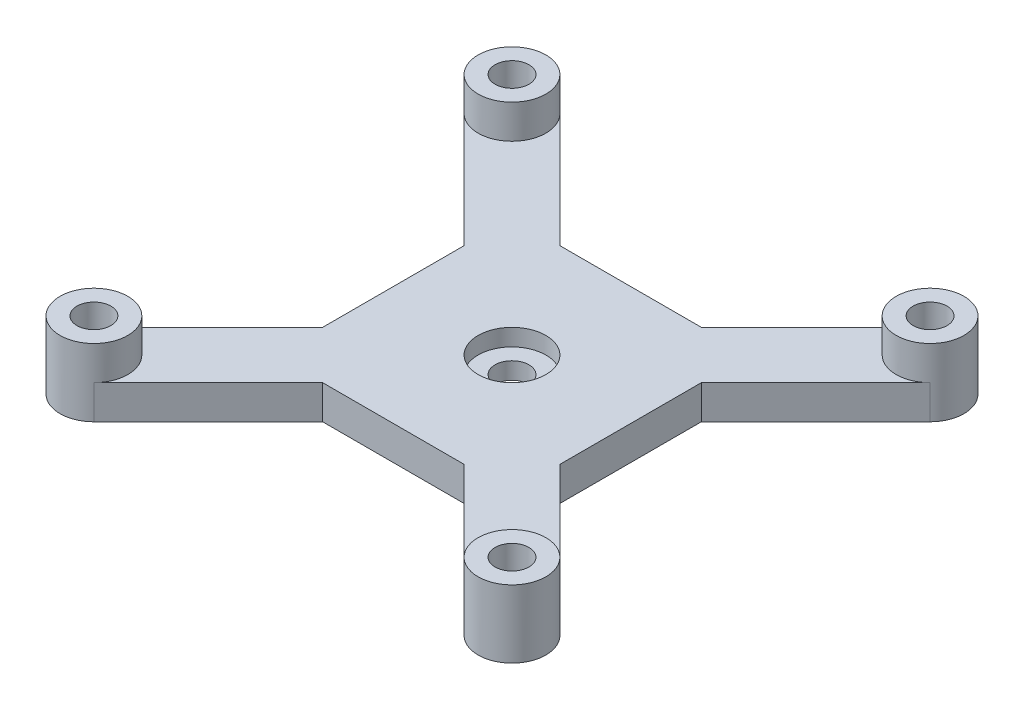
ISO-10303-21;
HEADER;
FILE_DESCRIPTION(('STEP AP214'),'2;1');
FILE_NAME('part.step','',(''),(''),'','','');
FILE_SCHEMA(('AUTOMOTIVE_DESIGN { 1 0 10303 214 1 1 1 1 }'));
ENDSEC;
DATA;
#1=APPLICATION_CONTEXT('core data for automotive mechanical design processes');
#2=APPLICATION_PROTOCOL_DEFINITION('international standard','automotive_design',2000,#1);
#3=PRODUCT_CONTEXT('',#1,'mechanical');
#4=PRODUCT('Part','Part','',(#3));
#5=PRODUCT_RELATED_PRODUCT_CATEGORY('part','',(#4));
#6=PRODUCT_DEFINITION_FORMATION('','',#4);
#7=PRODUCT_DEFINITION_CONTEXT('part definition',#1,'design');
#8=PRODUCT_DEFINITION('design','',#6,#7);
#9=PRODUCT_DEFINITION_SHAPE('','',#8);
#10=(LENGTH_UNIT() NAMED_UNIT(*) SI_UNIT(.MILLI.,.METRE.));
#11=(NAMED_UNIT(*) PLANE_ANGLE_UNIT() SI_UNIT($,.RADIAN.));
#12=(NAMED_UNIT(*) SI_UNIT($,.STERADIAN.) SOLID_ANGLE_UNIT());
#13=UNCERTAINTY_MEASURE_WITH_UNIT(LENGTH_MEASURE(1.E-05),#10,'distance_accuracy_value','');
#14=(GEOMETRIC_REPRESENTATION_CONTEXT(3) GLOBAL_UNCERTAINTY_ASSIGNED_CONTEXT((#13)) GLOBAL_UNIT_ASSIGNED_CONTEXT((#10,
#11,#12)) REPRESENTATION_CONTEXT('',''));
#15=CARTESIAN_POINT('',(0.,0.,0.));
#16=DIRECTION('',(0.,0.,1.));
#17=DIRECTION('',(1.,0.,0.));
#18=AXIS2_PLACEMENT_3D('',#15,#16,#17);
#19=CARTESIAN_POINT('',(-27.8991492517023,3.,-10.0179886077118));
#20=DIRECTION('',(0.,1.,0.));
#21=DIRECTION('',(0.,0.,1.));
#22=AXIS2_PLACEMENT_3D('',#19,#20,#21);
#23=PLANE('',#22);
#24=CARTESIAN_POINT('',(-9.39914925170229,3.,8.48201139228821));
#25=DIRECTION('',(0.,1.,0.));
#26=DIRECTION('',(0.,0.,1.));
#27=AXIS2_PLACEMENT_3D('',#24,#25,#26);
#28=CIRCLE('',#27,3.);
#29=CARTESIAN_POINT('',(-9.39914925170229,3.,11.4820113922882));
#30=VERTEX_POINT('',#29);
#31=EDGE_CURVE('E189',#30,#30,#28,.T.);
#32=ORIENTED_EDGE('',*,*,#31,.F.);
#33=EDGE_LOOP('',(#32));
#34=FACE_BOUND('',#33,.T.);
#35=DIRECTION('',(-0.707106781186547,0.,0.707106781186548));
#36=VECTOR('',#35,1.);
#37=CARTESIAN_POINT('',(-30.0204695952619,3.,24.8606910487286));
#38=LINE('',#37,#36);
#39=CARTESIAN_POINT('',(-19.8991492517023,3.,14.7393707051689));
#40=VERTEX_POINT('',#39);
#41=CARTESIAN_POINT('',(-30.0204695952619,3.,24.8606910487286));
#42=VERTEX_POINT('',#41);
#43=EDGE_CURVE('E213',#40,#42,#38,.T.);
#44=ORIENTED_EDGE('',*,*,#43,.T.);
#45=CARTESIAN_POINT('',(-27.8991492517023,3.,26.9820113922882));
#46=DIRECTION('',(0.,1.,0.));
#47=DIRECTION('',(0.,0.,1.));
#48=AXIS2_PLACEMENT_3D('',#45,#46,#47);
#49=CIRCLE('',#48,3.);
#50=CARTESIAN_POINT('',(-25.7778289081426,3.,29.1033317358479));
#51=VERTEX_POINT('',#50);
#52=EDGE_CURVE('E325',#51,#42,#49,.T.);
#53=ORIENTED_EDGE('',*,*,#52,.F.);
#54=DIRECTION('',(0.707106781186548,0.,-0.707106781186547));
#55=VECTOR('',#54,1.);
#56=CARTESIAN_POINT('',(-25.7778289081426,3.,29.1033317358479));
#57=LINE('',#56,#55);
#58=CARTESIAN_POINT('',(-15.656508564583,3.,18.9820113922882));
#59=VERTEX_POINT('',#58);
#60=EDGE_CURVE('E216',#51,#59,#57,.T.);
#61=ORIENTED_EDGE('',*,*,#60,.T.);
#62=DIRECTION('',(1.,0.,0.));
#63=VECTOR('',#62,1.);
#64=CARTESIAN_POINT('',(-15.656508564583,3.,18.9820113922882));
#65=LINE('',#64,#63);
#66=CARTESIAN_POINT('',(-3.14178993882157,3.,18.9820113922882));
#67=VERTEX_POINT('',#66);
#68=EDGE_CURVE('E218',#59,#67,#65,.T.);
#69=ORIENTED_EDGE('',*,*,#68,.T.);
#70=DIRECTION('',(0.707106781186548,0.,0.707106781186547));
#71=VECTOR('',#70,1.);
#72=CARTESIAN_POINT('',(-3.14178993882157,3.,18.9820113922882));
#73=LINE('',#72,#71);
#74=CARTESIAN_POINT('',(6.97953040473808,3.,29.1033317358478));
#75=VERTEX_POINT('',#74);
#76=EDGE_CURVE('E220',#67,#75,#73,.T.);
#77=ORIENTED_EDGE('',*,*,#76,.T.);
#78=CARTESIAN_POINT('',(9.10085074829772,3.,26.9820113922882));
#79=DIRECTION('',(0.,1.,0.));
#80=DIRECTION('',(0.,0.,1.));
#81=AXIS2_PLACEMENT_3D('',#78,#79,#80);
#82=CIRCLE('',#81,3.);
#83=CARTESIAN_POINT('',(11.2221710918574,3.,24.8606910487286));
#84=VERTEX_POINT('',#83);
#85=EDGE_CURVE('E343',#84,#75,#82,.T.);
#86=ORIENTED_EDGE('',*,*,#85,.F.);
#87=DIRECTION('',(-0.707106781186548,0.,-0.707106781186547));
#88=VECTOR('',#87,1.);
#89=CARTESIAN_POINT('',(1.10085074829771,3.,14.7393707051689));
#90=LINE('',#89,#88);
#91=CARTESIAN_POINT('',(1.10085074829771,3.,14.7393707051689));
#92=VERTEX_POINT('',#91);
#93=EDGE_CURVE('E222',#84,#92,#90,.T.);
#94=ORIENTED_EDGE('',*,*,#93,.T.);
#95=DIRECTION('',(0.,0.,-1.));
#96=VECTOR('',#95,1.);
#97=CARTESIAN_POINT('',(1.1008507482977,3.,2.22465207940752));
#98=LINE('',#97,#96);
#99=CARTESIAN_POINT('',(1.1008507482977,3.,2.22465207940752));
#100=VERTEX_POINT('',#99);
#101=EDGE_CURVE('E151',#92,#100,#98,.T.);
#102=ORIENTED_EDGE('',*,*,#101,.T.);
#103=DIRECTION('',(0.707106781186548,0.,-0.707106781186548));
#104=VECTOR('',#103,1.);
#105=CARTESIAN_POINT('',(1.1008507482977,3.,2.22465207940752));
#106=LINE('',#105,#104);
#107=CARTESIAN_POINT('',(11.2221710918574,3.,-7.89666826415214));
#108=VERTEX_POINT('',#107);
#109=EDGE_CURVE('E145',#100,#108,#106,.T.);
#110=ORIENTED_EDGE('',*,*,#109,.T.);
#111=CARTESIAN_POINT('',(9.10085074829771,3.,-10.0179886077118));
#112=DIRECTION('',(0.,1.,0.));
#113=DIRECTION('',(0.,0.,1.));
#114=AXIS2_PLACEMENT_3D('',#111,#112,#113);
#115=CIRCLE('',#114,3.00000000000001);
#116=CARTESIAN_POINT('',(6.97953040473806,3.,-12.1393089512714));
#117=VERTEX_POINT('',#116);
#118=EDGE_CURVE('E149',#117,#108,#115,.T.);
#119=ORIENTED_EDGE('',*,*,#118,.F.);
#120=DIRECTION('',(-0.707106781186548,0.,0.707106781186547));
#121=VECTOR('',#120,1.);
#122=CARTESIAN_POINT('',(-3.14178993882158,3.,-2.01798860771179));
#123=LINE('',#122,#121);
#124=CARTESIAN_POINT('',(-3.14178993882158,3.,-2.01798860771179));
#125=VERTEX_POINT('',#124);
#126=EDGE_CURVE('E155',#117,#125,#123,.T.);
#127=ORIENTED_EDGE('',*,*,#126,.T.);
#128=DIRECTION('',(-1.,0.,0.));
#129=VECTOR('',#128,1.);
#130=CARTESIAN_POINT('',(-15.656508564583,3.,-2.01798860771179));
#131=LINE('',#130,#129);
#132=CARTESIAN_POINT('',(-15.656508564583,3.,-2.01798860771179));
#133=VERTEX_POINT('',#132);
#134=EDGE_CURVE('E51',#125,#133,#131,.T.);
#135=ORIENTED_EDGE('',*,*,#134,.T.);
#136=DIRECTION('',(-0.707106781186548,0.,-0.707106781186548));
#137=VECTOR('',#136,1.);
#138=CARTESIAN_POINT('',(-25.7778289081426,3.,-12.1393089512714));
#139=LINE('',#138,#137);
#140=CARTESIAN_POINT('',(-25.7778289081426,3.,-12.1393089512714));
#141=VERTEX_POINT('',#140);
#142=EDGE_CURVE('E227',#133,#141,#139,.T.);
#143=ORIENTED_EDGE('',*,*,#142,.T.);
#144=CARTESIAN_POINT('',(-27.8991492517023,3.,-10.0179886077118));
#145=DIRECTION('',(0.,1.,0.));
#146=DIRECTION('',(0.,0.,1.));
#147=AXIS2_PLACEMENT_3D('',#144,#145,#146);
#148=CIRCLE('',#147,3.);
#149=CARTESIAN_POINT('',(-30.0204695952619,3.,-7.89666826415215));
#150=VERTEX_POINT('',#149);
#151=EDGE_CURVE('E11',#150,#141,#148,.T.);
#152=ORIENTED_EDGE('',*,*,#151,.F.);
#153=DIRECTION('',(0.707106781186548,0.,0.707106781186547));
#154=VECTOR('',#153,1.);
#155=CARTESIAN_POINT('',(-30.0204695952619,3.,-7.89666826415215));
#156=LINE('',#155,#154);
#157=CARTESIAN_POINT('',(-19.8991492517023,3.,2.22465207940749));
#158=VERTEX_POINT('',#157);
#159=EDGE_CURVE('E214',#150,#158,#156,.T.);
#160=ORIENTED_EDGE('',*,*,#159,.T.);
#161=DIRECTION('',(0.,0.,1.));
#162=VECTOR('',#161,1.);
#163=CARTESIAN_POINT('',(-19.8991492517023,3.,2.22465207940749));
#164=LINE('',#163,#162);
#165=EDGE_CURVE('E211',#158,#40,#164,.T.);
#166=ORIENTED_EDGE('',*,*,#165,.T.);
#167=EDGE_LOOP('',(#44,#53,#61,#69,#77,#86,#94,#102,#110,#119,#127,#135,#143,#152,#160,#166));
#168=FACE_BOUND('',#167,.T.);
#169=ADVANCED_FACE('F32',(#34,#168),#23,.T.);
#170=CARTESIAN_POINT('',(-9.39914925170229,3.,8.48201139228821));
#171=DIRECTION('',(0.,-1.,0.));
#172=DIRECTION('',(0.,0.,-1.));
#173=AXIS2_PLACEMENT_3D('',#170,#171,#172);
#174=CYLINDRICAL_SURFACE('',#173,1.5);
#175=CARTESIAN_POINT('',(-9.39914925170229,0.,8.48201139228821));
#176=DIRECTION('',(0.,1.,0.));
#177=DIRECTION('',(0.,0.,1.));
#178=AXIS2_PLACEMENT_3D('',#175,#176,#177);
#179=CIRCLE('',#178,1.5);
#180=CARTESIAN_POINT('',(-9.39914925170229,0.,9.98201139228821));
#181=VERTEX_POINT('',#180);
#182=EDGE_CURVE('E193',#181,#181,#179,.T.);
#183=ORIENTED_EDGE('',*,*,#182,.F.);
#184=EDGE_LOOP('',(#183));
#185=FACE_BOUND('',#184,.T.);
#186=CARTESIAN_POINT('',(-9.39914925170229,1.5,8.48201139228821));
#187=DIRECTION('',(0.,1.,0.));
#188=DIRECTION('',(0.,0.,1.));
#189=AXIS2_PLACEMENT_3D('',#186,#187,#188);
#190=CIRCLE('',#189,1.5);
#191=CARTESIAN_POINT('',(-9.39914925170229,1.5,9.98201139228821));
#192=VERTEX_POINT('',#191);
#193=EDGE_CURVE('E186',#192,#192,#190,.T.);
#194=ORIENTED_EDGE('',*,*,#193,.T.);
#195=EDGE_LOOP('',(#194));
#196=FACE_BOUND('',#195,.T.);
#197=ADVANCED_FACE('F377',(#185,#196),#174,.F.);
#198=CARTESIAN_POINT('',(-27.8991492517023,0.,-10.0179886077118));
#199=DIRECTION('',(0.,1.,0.));
#200=DIRECTION('',(0.,0.,1.));
#201=AXIS2_PLACEMENT_3D('',#198,#199,#200);
#202=PLANE('',#201);
#203=CARTESIAN_POINT('',(-27.8991492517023,0.,26.9820113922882));
#204=DIRECTION('',(0.,1.,0.));
#205=DIRECTION('',(0.,0.,1.));
#206=AXIS2_PLACEMENT_3D('',#203,#204,#205);
#207=CIRCLE('',#206,1.5);
#208=CARTESIAN_POINT('',(-27.8991492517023,0.,28.4820113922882));
#209=VERTEX_POINT('',#208);
#210=EDGE_CURVE('E198',#209,#209,#207,.T.);
#211=ORIENTED_EDGE('',*,*,#210,.T.);
#212=EDGE_LOOP('',(#211));
#213=FACE_BOUND('',#212,.T.);
#214=CARTESIAN_POINT('',(9.10085074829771,0.,-10.0179886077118));
#215=DIRECTION('',(0.,1.,0.));
#216=DIRECTION('',(0.,0.,1.));
#217=AXIS2_PLACEMENT_3D('',#214,#215,#216);
#218=CIRCLE('',#217,1.5);
#219=CARTESIAN_POINT('',(9.10085074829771,0.,-8.51798860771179));
#220=VERTEX_POINT('',#219);
#221=EDGE_CURVE('E204',#220,#220,#218,.T.);
#222=ORIENTED_EDGE('',*,*,#221,.T.);
#223=EDGE_LOOP('',(#222));
#224=FACE_BOUND('',#223,.T.);
#225=CARTESIAN_POINT('',(-27.8991492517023,0.,-10.0179886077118));
#226=DIRECTION('',(0.,1.,0.));
#227=DIRECTION('',(0.,0.,1.));
#228=AXIS2_PLACEMENT_3D('',#225,#226,#227);
#229=CIRCLE('',#228,3.);
#230=CARTESIAN_POINT('',(-25.7778289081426,0.,-12.1393089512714));
#231=VERTEX_POINT('',#230);
#232=CARTESIAN_POINT('',(-30.0204695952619,0.,-7.89666826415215));
#233=VERTEX_POINT('',#232);
#234=EDGE_CURVE('E210',#231,#233,#229,.T.);
#235=ORIENTED_EDGE('',*,*,#234,.F.);
#236=DIRECTION('',(-0.707106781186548,0.,-0.707106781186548));
#237=VECTOR('',#236,1.);
#238=CARTESIAN_POINT('',(-25.7778289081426,0.,-12.1393089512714));
#239=LINE('',#238,#237);
#240=CARTESIAN_POINT('',(-15.656508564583,0.,-2.01798860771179));
#241=VERTEX_POINT('',#240);
#242=EDGE_CURVE('E111',#241,#231,#239,.T.);
#243=ORIENTED_EDGE('',*,*,#242,.F.);
#244=DIRECTION('',(-1.,0.,0.));
#245=VECTOR('',#244,1.);
#246=CARTESIAN_POINT('',(-15.656508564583,0.,-2.01798860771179));
#247=LINE('',#246,#245);
#248=CARTESIAN_POINT('',(-3.14178993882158,0.,-2.01798860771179));
#249=VERTEX_POINT('',#248);
#250=EDGE_CURVE('E104',#249,#241,#247,.T.);
#251=ORIENTED_EDGE('',*,*,#250,.F.);
#252=DIRECTION('',(-0.707106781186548,0.,0.707106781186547));
#253=VECTOR('',#252,1.);
#254=CARTESIAN_POINT('',(-3.14178993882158,0.,-2.01798860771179));
#255=LINE('',#254,#253);
#256=CARTESIAN_POINT('',(6.97953040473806,0.,-12.1393089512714));
#257=VERTEX_POINT('',#256);
#258=EDGE_CURVE('E253',#257,#249,#255,.T.);
#259=ORIENTED_EDGE('',*,*,#258,.F.);
#260=CARTESIAN_POINT('',(9.10085074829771,0.,-10.0179886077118));
#261=DIRECTION('',(0.,1.,0.));
#262=DIRECTION('',(0.,0.,1.));
#263=AXIS2_PLACEMENT_3D('',#260,#261,#262);
#264=CIRCLE('',#263,3.00000000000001);
#265=CARTESIAN_POINT('',(11.2221710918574,0.,-7.89666826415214));
#266=VERTEX_POINT('',#265);
#267=EDGE_CURVE('E251',#266,#257,#264,.T.);
#268=ORIENTED_EDGE('',*,*,#267,.F.);
#269=DIRECTION('',(0.707106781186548,0.,-0.707106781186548));
#270=VECTOR('',#269,1.);
#271=CARTESIAN_POINT('',(1.1008507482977,0.,2.22465207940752));
#272=LINE('',#271,#270);
#273=CARTESIAN_POINT('',(1.1008507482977,0.,2.22465207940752));
#274=VERTEX_POINT('',#273);
#275=EDGE_CURVE('E161',#274,#266,#272,.T.);
#276=ORIENTED_EDGE('',*,*,#275,.F.);
#277=DIRECTION('',(0.,0.,-1.));
#278=VECTOR('',#277,1.);
#279=CARTESIAN_POINT('',(1.1008507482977,0.,2.22465207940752));
#280=LINE('',#279,#278);
#281=CARTESIAN_POINT('',(1.10085074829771,0.,14.7393707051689));
#282=VERTEX_POINT('',#281);
#283=EDGE_CURVE('E248',#282,#274,#280,.T.);
#284=ORIENTED_EDGE('',*,*,#283,.F.);
#285=DIRECTION('',(-0.707106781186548,0.,-0.707106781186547));
#286=VECTOR('',#285,1.);
#287=CARTESIAN_POINT('',(1.10085074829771,0.,14.7393707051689));
#288=LINE('',#287,#286);
#289=CARTESIAN_POINT('',(11.2221710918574,0.,24.8606910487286));
#290=VERTEX_POINT('',#289);
#291=EDGE_CURVE('E246',#290,#282,#288,.T.);
#292=ORIENTED_EDGE('',*,*,#291,.F.);
#293=CARTESIAN_POINT('',(9.10085074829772,0.,26.9820113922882));
#294=DIRECTION('',(0.,1.,0.));
#295=DIRECTION('',(0.,0.,1.));
#296=AXIS2_PLACEMENT_3D('',#293,#294,#295);
#297=CIRCLE('',#296,3.);
#298=CARTESIAN_POINT('',(6.97953040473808,0.,29.1033317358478));
#299=VERTEX_POINT('',#298);
#300=EDGE_CURVE('E244',#299,#290,#297,.T.);
#301=ORIENTED_EDGE('',*,*,#300,.F.);
#302=DIRECTION('',(0.707106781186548,0.,0.707106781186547));
#303=VECTOR('',#302,1.);
#304=CARTESIAN_POINT('',(-3.14178993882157,0.,18.9820113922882));
#305=LINE('',#304,#303);
#306=CARTESIAN_POINT('',(-3.14178993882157,0.,18.9820113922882));
#307=VERTEX_POINT('',#306);
#308=EDGE_CURVE('E242',#307,#299,#305,.T.);
#309=ORIENTED_EDGE('',*,*,#308,.F.);
#310=DIRECTION('',(1.,0.,0.));
#311=VECTOR('',#310,1.);
#312=CARTESIAN_POINT('',(-15.656508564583,0.,18.9820113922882));
#313=LINE('',#312,#311);
#314=CARTESIAN_POINT('',(-15.656508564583,0.,18.9820113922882));
#315=VERTEX_POINT('',#314);
#316=EDGE_CURVE('E240',#315,#307,#313,.T.);
#317=ORIENTED_EDGE('',*,*,#316,.F.);
#318=DIRECTION('',(0.707106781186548,0.,-0.707106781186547));
#319=VECTOR('',#318,1.);
#320=CARTESIAN_POINT('',(-25.7778289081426,0.,29.1033317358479));
#321=LINE('',#320,#319);
#322=CARTESIAN_POINT('',(-25.7778289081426,0.,29.1033317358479));
#323=VERTEX_POINT('',#322);
#324=EDGE_CURVE('E238',#323,#315,#321,.T.);
#325=ORIENTED_EDGE('',*,*,#324,.F.);
#326=CARTESIAN_POINT('',(-27.8991492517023,0.,26.9820113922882));
#327=DIRECTION('',(0.,1.,0.));
#328=DIRECTION('',(0.,0.,1.));
#329=AXIS2_PLACEMENT_3D('',#326,#327,#328);
#330=CIRCLE('',#329,3.);
#331=CARTESIAN_POINT('',(-30.0204695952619,0.,24.8606910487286));
#332=VERTEX_POINT('',#331);
#333=EDGE_CURVE('E236',#332,#323,#330,.T.);
#334=ORIENTED_EDGE('',*,*,#333,.F.);
#335=DIRECTION('',(-0.707106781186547,0.,0.707106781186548));
#336=VECTOR('',#335,1.);
#337=CARTESIAN_POINT('',(-30.0204695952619,0.,24.8606910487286));
#338=LINE('',#337,#336);
#339=CARTESIAN_POINT('',(-19.8991492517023,0.,14.7393707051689));
#340=VERTEX_POINT('',#339);
#341=EDGE_CURVE('E234',#340,#332,#338,.T.);
#342=ORIENTED_EDGE('',*,*,#341,.F.);
#343=DIRECTION('',(0.,0.,1.));
#344=VECTOR('',#343,1.);
#345=CARTESIAN_POINT('',(-19.8991492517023,0.,2.22465207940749));
#346=LINE('',#345,#344);
#347=CARTESIAN_POINT('',(-19.8991492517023,0.,2.22465207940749));
#348=VERTEX_POINT('',#347);
#349=EDGE_CURVE('E232',#348,#340,#346,.T.);
#350=ORIENTED_EDGE('',*,*,#349,.F.);
#351=DIRECTION('',(0.707106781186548,0.,0.707106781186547));
#352=VECTOR('',#351,1.);
#353=CARTESIAN_POINT('',(-30.0204695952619,0.,-7.89666826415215));
#354=LINE('',#353,#352);
#355=EDGE_CURVE('E230',#233,#348,#354,.T.);
#356=ORIENTED_EDGE('',*,*,#355,.F.);
#357=EDGE_LOOP('',(#235,#243,#251,#259,#268,#276,#284,#292,#301,#309,#317,#325,#334,#342,#350,#356));
#358=FACE_BOUND('',#357,.T.);
#359=CARTESIAN_POINT('',(-27.8991492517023,0.,-10.0179886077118));
#360=DIRECTION('',(0.,1.,0.));
#361=DIRECTION('',(0.,0.,1.));
#362=AXIS2_PLACEMENT_3D('',#359,#360,#361);
#363=CIRCLE('',#362,1.5);
#364=CARTESIAN_POINT('',(-27.8991492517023,0.,-8.51798860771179));
#365=VERTEX_POINT('',#364);
#366=EDGE_CURVE('E207',#365,#365,#363,.T.);
#367=ORIENTED_EDGE('',*,*,#366,.T.);
#368=EDGE_LOOP('',(#367));
#369=FACE_BOUND('',#368,.T.);
#370=CARTESIAN_POINT('',(9.10085074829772,0.,26.9820113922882));
#371=DIRECTION('',(0.,1.,0.));
#372=DIRECTION('',(0.,0.,1.));
#373=AXIS2_PLACEMENT_3D('',#370,#371,#372);
#374=CIRCLE('',#373,1.5);
#375=CARTESIAN_POINT('',(9.10085074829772,0.,28.4820113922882));
#376=VERTEX_POINT('',#375);
#377=EDGE_CURVE('E201',#376,#376,#374,.T.);
#378=ORIENTED_EDGE('',*,*,#377,.T.);
#379=EDGE_LOOP('',(#378));
#380=FACE_BOUND('',#379,.T.);
#381=ORIENTED_EDGE('',*,*,#182,.T.);
#382=EDGE_LOOP('',(#381));
#383=FACE_BOUND('',#382,.T.);
#384=ADVANCED_FACE('F309',(#213,#224,#358,#369,#380,#383),#202,.F.);
#385=CARTESIAN_POINT('',(-27.8991492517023,3.,-10.0179886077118));
#386=DIRECTION('',(0.,-1.,0.));
#387=DIRECTION('',(0.,0.,-1.));
#388=AXIS2_PLACEMENT_3D('',#385,#386,#387);
#389=CYLINDRICAL_SURFACE('',#388,3.);
#390=ORIENTED_EDGE('',*,*,#234,.T.);
#391=DIRECTION('',(0.,-1.,0.));
#392=VECTOR('',#391,1.);
#393=CARTESIAN_POINT('',(-30.0204695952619,3.,-7.89666826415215));
#394=LINE('',#393,#392);
#395=EDGE_CURVE('E42',#150,#233,#394,.T.);
#396=ORIENTED_EDGE('',*,*,#395,.F.);
#397=ORIENTED_EDGE('',*,*,#151,.T.);
#398=DIRECTION('',(0.,-1.,0.));
#399=VECTOR('',#398,1.);
#400=CARTESIAN_POINT('',(-25.7778289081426,3.,-12.1393089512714));
#401=LINE('',#400,#399);
#402=EDGE_CURVE('E260',#141,#231,#401,.T.);
#403=ORIENTED_EDGE('',*,*,#402,.T.);
#404=EDGE_LOOP('',(#390,#396,#397,#403));
#405=FACE_BOUND('',#404,.T.);
#406=CARTESIAN_POINT('',(-27.8991492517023,6.,-10.0179886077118));
#407=DIRECTION('',(0.,1.,0.));
#408=DIRECTION('',(0.,0.,1.));
#409=AXIS2_PLACEMENT_3D('',#406,#407,#408);
#410=CIRCLE('',#409,3.);
#411=CARTESIAN_POINT('',(-27.8991492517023,6.,-7.01798860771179));
#412=VERTEX_POINT('',#411);
#413=EDGE_CURVE('E183',#412,#412,#410,.T.);
#414=ORIENTED_EDGE('',*,*,#413,.F.);
#415=EDGE_LOOP('',(#414));
#416=FACE_BOUND('',#415,.T.);
#417=ADVANCED_FACE('F34',(#405,#416),#389,.T.);
#418=CARTESIAN_POINT('',(-30.0204695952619,3.,-7.89666826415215));
#419=DIRECTION('',(0.707106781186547,0.,-0.707106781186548));
#420=DIRECTION('',(-0.707106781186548,0.,-0.707106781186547));
#421=AXIS2_PLACEMENT_3D('',#418,#419,#420);
#422=PLANE('',#421);
#423=ORIENTED_EDGE('',*,*,#355,.T.);
#424=DIRECTION('',(0.,-1.,0.));
#425=VECTOR('',#424,1.);
#426=CARTESIAN_POINT('',(-19.8991492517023,3.,2.22465207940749));
#427=LINE('',#426,#425);
#428=EDGE_CURVE('E288',#158,#348,#427,.T.);
#429=ORIENTED_EDGE('',*,*,#428,.F.);
#430=ORIENTED_EDGE('',*,*,#159,.F.);
#431=ORIENTED_EDGE('',*,*,#395,.T.);
#432=EDGE_LOOP('',(#423,#429,#430,#431));
#433=FACE_BOUND('',#432,.T.);
#434=ADVANCED_FACE('F303',(#433),#422,.F.);
#435=CARTESIAN_POINT('',(-19.8991492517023,3.,2.22465207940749));
#436=DIRECTION('',(1.,0.,0.));
#437=DIRECTION('',(0.,0.,-1.));
#438=AXIS2_PLACEMENT_3D('',#435,#436,#437);
#439=PLANE('',#438);
#440=ORIENTED_EDGE('',*,*,#349,.T.);
#441=DIRECTION('',(0.,-1.,0.));
#442=VECTOR('',#441,1.);
#443=CARTESIAN_POINT('',(-19.8991492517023,3.,14.7393707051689));
#444=LINE('',#443,#442);
#445=EDGE_CURVE('E285',#40,#340,#444,.T.);
#446=ORIENTED_EDGE('',*,*,#445,.F.);
#447=ORIENTED_EDGE('',*,*,#165,.F.);
#448=ORIENTED_EDGE('',*,*,#428,.T.);
#449=EDGE_LOOP('',(#440,#446,#447,#448));
#450=FACE_BOUND('',#449,.T.);
#451=ADVANCED_FACE('F316',(#450),#439,.F.);
#452=CARTESIAN_POINT('',(-30.0204695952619,3.,24.8606910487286));
#453=DIRECTION('',(0.707106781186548,0.,0.707106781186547));
#454=DIRECTION('',(0.707106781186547,0.,-0.707106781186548));
#455=AXIS2_PLACEMENT_3D('',#452,#453,#454);
#456=PLANE('',#455);
#457=ORIENTED_EDGE('',*,*,#341,.T.);
#458=DIRECTION('',(0.,-1.,0.));
#459=VECTOR('',#458,1.);
#460=CARTESIAN_POINT('',(-30.0204695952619,3.,24.8606910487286));
#461=LINE('',#460,#459);
#462=EDGE_CURVE('E282',#42,#332,#461,.T.);
#463=ORIENTED_EDGE('',*,*,#462,.F.);
#464=ORIENTED_EDGE('',*,*,#43,.F.);
#465=ORIENTED_EDGE('',*,*,#445,.T.);
#466=EDGE_LOOP('',(#457,#463,#464,#465));
#467=FACE_BOUND('',#466,.T.);
#468=ADVANCED_FACE('F320',(#467),#456,.F.);
#469=CARTESIAN_POINT('',(-27.8991492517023,3.,26.9820113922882));
#470=DIRECTION('',(0.,-1.,0.));
#471=DIRECTION('',(0.,0.,-1.));
#472=AXIS2_PLACEMENT_3D('',#469,#470,#471);
#473=CYLINDRICAL_SURFACE('',#472,3.);
#474=ORIENTED_EDGE('',*,*,#333,.T.);
#475=DIRECTION('',(0.,-1.,0.));
#476=VECTOR('',#475,1.);
#477=CARTESIAN_POINT('',(-25.7778289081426,3.,29.1033317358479));
#478=LINE('',#477,#476);
#479=EDGE_CURVE('E279',#51,#323,#478,.T.);
#480=ORIENTED_EDGE('',*,*,#479,.F.);
#481=ORIENTED_EDGE('',*,*,#52,.T.);
#482=ORIENTED_EDGE('',*,*,#462,.T.);
#483=EDGE_LOOP('',(#474,#480,#481,#482));
#484=FACE_BOUND('',#483,.T.);
#485=CARTESIAN_POINT('',(-27.8991492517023,6.,26.9820113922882));
#486=DIRECTION('',(0.,1.,0.));
#487=DIRECTION('',(0.,0.,1.));
#488=AXIS2_PLACEMENT_3D('',#485,#486,#487);
#489=CIRCLE('',#488,3.);
#490=CARTESIAN_POINT('',(-27.8991492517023,6.,29.9820113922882));
#491=VERTEX_POINT('',#490);
#492=EDGE_CURVE('E332',#491,#491,#489,.T.);
#493=ORIENTED_EDGE('',*,*,#492,.F.);
#494=EDGE_LOOP('',(#493));
#495=FACE_BOUND('',#494,.T.);
#496=ADVANCED_FACE('F471',(#484,#495),#473,.T.);
#497=CARTESIAN_POINT('',(-25.7778289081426,3.,29.1033317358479));
#498=DIRECTION('',(-0.707106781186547,0.,-0.707106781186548));
#499=DIRECTION('',(-0.707106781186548,0.,0.707106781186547));
#500=AXIS2_PLACEMENT_3D('',#497,#498,#499);
#501=PLANE('',#500);
#502=ORIENTED_EDGE('',*,*,#324,.T.);
#503=DIRECTION('',(0.,-1.,0.));
#504=VECTOR('',#503,1.);
#505=CARTESIAN_POINT('',(-15.656508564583,3.,18.9820113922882));
#506=LINE('',#505,#504);
#507=EDGE_CURVE('E276',#59,#315,#506,.T.);
#508=ORIENTED_EDGE('',*,*,#507,.F.);
#509=ORIENTED_EDGE('',*,*,#60,.F.);
#510=ORIENTED_EDGE('',*,*,#479,.T.);
#511=EDGE_LOOP('',(#502,#508,#509,#510));
#512=FACE_BOUND('',#511,.T.);
#513=ADVANCED_FACE('F467',(#512),#501,.F.);
#514=CARTESIAN_POINT('',(-15.656508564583,3.,18.9820113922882));
#515=DIRECTION('',(0.,0.,-1.));
#516=DIRECTION('',(-1.,0.,0.));
#517=AXIS2_PLACEMENT_3D('',#514,#515,#516);
#518=PLANE('',#517);
#519=ORIENTED_EDGE('',*,*,#316,.T.);
#520=DIRECTION('',(0.,-1.,0.));
#521=VECTOR('',#520,1.);
#522=CARTESIAN_POINT('',(-3.14178993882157,3.,18.9820113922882));
#523=LINE('',#522,#521);
#524=EDGE_CURVE('E273',#67,#307,#523,.T.);
#525=ORIENTED_EDGE('',*,*,#524,.F.);
#526=ORIENTED_EDGE('',*,*,#68,.F.);
#527=ORIENTED_EDGE('',*,*,#507,.T.);
#528=EDGE_LOOP('',(#519,#525,#526,#527));
#529=FACE_BOUND('',#528,.T.);
#530=ADVANCED_FACE('F460',(#529),#518,.F.);
#531=CARTESIAN_POINT('',(-3.14178993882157,3.,18.9820113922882));
#532=DIRECTION('',(0.707106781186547,0.,-0.707106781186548));
#533=DIRECTION('',(-0.707106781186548,0.,-0.707106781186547));
#534=AXIS2_PLACEMENT_3D('',#531,#532,#533);
#535=PLANE('',#534);
#536=ORIENTED_EDGE('',*,*,#308,.T.);
#537=DIRECTION('',(0.,-1.,0.));
#538=VECTOR('',#537,1.);
#539=CARTESIAN_POINT('',(6.97953040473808,3.,29.1033317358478));
#540=LINE('',#539,#538);
#541=EDGE_CURVE('E270',#75,#299,#540,.T.);
#542=ORIENTED_EDGE('',*,*,#541,.F.);
#543=ORIENTED_EDGE('',*,*,#76,.F.);
#544=ORIENTED_EDGE('',*,*,#524,.T.);
#545=EDGE_LOOP('',(#536,#542,#543,#544));
#546=FACE_BOUND('',#545,.T.);
#547=ADVANCED_FACE('F452',(#546),#535,.F.);
#548=CARTESIAN_POINT('',(9.10085074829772,3.,26.9820113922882));
#549=DIRECTION('',(0.,-1.,0.));
#550=DIRECTION('',(0.,0.,-1.));
#551=AXIS2_PLACEMENT_3D('',#548,#549,#550);
#552=CYLINDRICAL_SURFACE('',#551,3.);
#553=ORIENTED_EDGE('',*,*,#300,.T.);
#554=DIRECTION('',(0.,-1.,0.));
#555=VECTOR('',#554,1.);
#556=CARTESIAN_POINT('',(11.2221710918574,3.,24.8606910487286));
#557=LINE('',#556,#555);
#558=EDGE_CURVE('E267',#84,#290,#557,.T.);
#559=ORIENTED_EDGE('',*,*,#558,.F.);
#560=ORIENTED_EDGE('',*,*,#85,.T.);
#561=ORIENTED_EDGE('',*,*,#541,.T.);
#562=EDGE_LOOP('',(#553,#559,#560,#561));
#563=FACE_BOUND('',#562,.T.);
#564=CARTESIAN_POINT('',(9.10085074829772,6.,26.9820113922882));
#565=DIRECTION('',(0.,1.,0.));
#566=DIRECTION('',(0.,0.,1.));
#567=AXIS2_PLACEMENT_3D('',#564,#565,#566);
#568=CIRCLE('',#567,3.);
#569=CARTESIAN_POINT('',(9.10085074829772,6.,29.9820113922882));
#570=VERTEX_POINT('',#569);
#571=EDGE_CURVE('E178',#570,#570,#568,.T.);
#572=ORIENTED_EDGE('',*,*,#571,.F.);
#573=EDGE_LOOP('',(#572));
#574=FACE_BOUND('',#573,.T.);
#575=ADVANCED_FACE('F350',(#563,#574),#552,.T.);
#576=CARTESIAN_POINT('',(1.10085074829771,3.,14.7393707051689));
#577=DIRECTION('',(-0.707106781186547,0.,0.707106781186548));
#578=DIRECTION('',(0.707106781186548,0.,0.707106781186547));
#579=AXIS2_PLACEMENT_3D('',#576,#577,#578);
#580=PLANE('',#579);
#581=ORIENTED_EDGE('',*,*,#291,.T.);
#582=DIRECTION('',(0.,-1.,0.));
#583=VECTOR('',#582,1.);
#584=CARTESIAN_POINT('',(1.10085074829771,3.,14.7393707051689));
#585=LINE('',#584,#583);
#586=EDGE_CURVE('E264',#92,#282,#585,.T.);
#587=ORIENTED_EDGE('',*,*,#586,.F.);
#588=ORIENTED_EDGE('',*,*,#93,.F.);
#589=ORIENTED_EDGE('',*,*,#558,.T.);
#590=EDGE_LOOP('',(#581,#587,#588,#589));
#591=FACE_BOUND('',#590,.T.);
#592=ADVANCED_FACE('F451',(#591),#580,.F.);
#593=CARTESIAN_POINT('',(1.1008507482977,3.,2.22465207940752));
#594=DIRECTION('',(-1.,0.,0.));
#595=DIRECTION('',(0.,0.,1.));
#596=AXIS2_PLACEMENT_3D('',#593,#594,#595);
#597=PLANE('',#596);
#598=ORIENTED_EDGE('',*,*,#283,.T.);
#599=DIRECTION('',(0.,-1.,0.));
#600=VECTOR('',#599,1.);
#601=CARTESIAN_POINT('',(1.1008507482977,3.,2.22465207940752));
#602=LINE('',#601,#600);
#603=EDGE_CURVE('E164',#100,#274,#602,.T.);
#604=ORIENTED_EDGE('',*,*,#603,.F.);
#605=ORIENTED_EDGE('',*,*,#101,.F.);
#606=ORIENTED_EDGE('',*,*,#586,.T.);
#607=EDGE_LOOP('',(#598,#604,#605,#606));
#608=FACE_BOUND('',#607,.T.);
#609=ADVANCED_FACE('F458',(#608),#597,.F.);
#610=CARTESIAN_POINT('',(1.1008507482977,3.,2.22465207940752));
#611=DIRECTION('',(-0.707106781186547,0.,-0.707106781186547));
#612=DIRECTION('',(-0.707106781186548,0.,0.707106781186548));
#613=AXIS2_PLACEMENT_3D('',#610,#611,#612);
#614=PLANE('',#613);
#615=ORIENTED_EDGE('',*,*,#275,.T.);
#616=DIRECTION('',(0.,-1.,0.));
#617=VECTOR('',#616,1.);
#618=CARTESIAN_POINT('',(11.2221710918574,3.,-7.89666826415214));
#619=LINE('',#618,#617);
#620=EDGE_CURVE('E158',#108,#266,#619,.T.);
#621=ORIENTED_EDGE('',*,*,#620,.F.);
#622=ORIENTED_EDGE('',*,*,#109,.F.);
#623=ORIENTED_EDGE('',*,*,#603,.T.);
#624=EDGE_LOOP('',(#615,#621,#622,#623));
#625=FACE_BOUND('',#624,.T.);
#626=ADVANCED_FACE('F159',(#625),#614,.F.);
#627=CARTESIAN_POINT('',(9.10085074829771,3.,-10.0179886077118));
#628=DIRECTION('',(0.,-1.,0.));
#629=DIRECTION('',(0.,0.,-1.));
#630=AXIS2_PLACEMENT_3D('',#627,#628,#629);
#631=CYLINDRICAL_SURFACE('',#630,3.00000000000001);
#632=ORIENTED_EDGE('',*,*,#267,.T.);
#633=DIRECTION('',(0.,-1.,0.));
#634=VECTOR('',#633,1.);
#635=CARTESIAN_POINT('',(6.97953040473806,3.,-12.1393089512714));
#636=LINE('',#635,#634);
#637=EDGE_CURVE('E165',#117,#257,#636,.T.);
#638=ORIENTED_EDGE('',*,*,#637,.F.);
#639=ORIENTED_EDGE('',*,*,#118,.T.);
#640=ORIENTED_EDGE('',*,*,#620,.T.);
#641=EDGE_LOOP('',(#632,#638,#639,#640));
#642=FACE_BOUND('',#641,.T.);
#643=CARTESIAN_POINT('',(9.10085074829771,6.,-10.0179886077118));
#644=DIRECTION('',(0.,1.,0.));
#645=DIRECTION('',(0.,0.,1.));
#646=AXIS2_PLACEMENT_3D('',#643,#644,#645);
#647=CIRCLE('',#646,3.00000000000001);
#648=CARTESIAN_POINT('',(9.10085074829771,6.,-7.01798860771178));
#649=VERTEX_POINT('',#648);
#650=EDGE_CURVE('E171',#649,#649,#647,.T.);
#651=ORIENTED_EDGE('',*,*,#650,.F.);
#652=EDGE_LOOP('',(#651));
#653=FACE_BOUND('',#652,.T.);
#654=ADVANCED_FACE('F168',(#642,#653),#631,.T.);
#655=CARTESIAN_POINT('',(-3.14178993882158,3.,-2.01798860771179));
#656=DIRECTION('',(0.707106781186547,0.,0.707106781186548));
#657=DIRECTION('',(0.707106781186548,0.,-0.707106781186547));
#658=AXIS2_PLACEMENT_3D('',#655,#656,#657);
#659=PLANE('',#658);
#660=ORIENTED_EDGE('',*,*,#258,.T.);
#661=DIRECTION('',(0.,-1.,0.));
#662=VECTOR('',#661,1.);
#663=CARTESIAN_POINT('',(-3.14178993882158,3.,-2.01798860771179));
#664=LINE('',#663,#662);
#665=EDGE_CURVE('E259',#125,#249,#664,.T.);
#666=ORIENTED_EDGE('',*,*,#665,.F.);
#667=ORIENTED_EDGE('',*,*,#126,.F.);
#668=ORIENTED_EDGE('',*,*,#637,.T.);
#669=EDGE_LOOP('',(#660,#666,#667,#668));
#670=FACE_BOUND('',#669,.T.);
#671=ADVANCED_FACE('F367',(#670),#659,.F.);
#672=CARTESIAN_POINT('',(-15.656508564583,3.,-2.01798860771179));
#673=DIRECTION('',(0.,0.,1.));
#674=DIRECTION('',(1.,0.,0.));
#675=AXIS2_PLACEMENT_3D('',#672,#673,#674);
#676=PLANE('',#675);
#677=ORIENTED_EDGE('',*,*,#250,.T.);
#678=DIRECTION('',(0.,-1.,0.));
#679=VECTOR('',#678,1.);
#680=CARTESIAN_POINT('',(-15.656508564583,3.,-2.01798860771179));
#681=LINE('',#680,#679);
#682=EDGE_CURVE('E257',#133,#241,#681,.T.);
#683=ORIENTED_EDGE('',*,*,#682,.F.);
#684=ORIENTED_EDGE('',*,*,#134,.F.);
#685=ORIENTED_EDGE('',*,*,#665,.T.);
#686=EDGE_LOOP('',(#677,#683,#684,#685));
#687=FACE_BOUND('',#686,.T.);
#688=ADVANCED_FACE('F365',(#687),#676,.F.);
#689=CARTESIAN_POINT('',(-25.7778289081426,3.,-12.1393089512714));
#690=DIRECTION('',(-0.707106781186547,0.,0.707106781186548));
#691=DIRECTION('',(0.707106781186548,0.,0.707106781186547));
#692=AXIS2_PLACEMENT_3D('',#689,#690,#691);
#693=PLANE('',#692);
#694=ORIENTED_EDGE('',*,*,#242,.T.);
#695=ORIENTED_EDGE('',*,*,#402,.F.);
#696=ORIENTED_EDGE('',*,*,#142,.F.);
#697=ORIENTED_EDGE('',*,*,#682,.T.);
#698=EDGE_LOOP('',(#694,#695,#696,#697));
#699=FACE_BOUND('',#698,.T.);
#700=ADVANCED_FACE('F363',(#699),#693,.F.);
#701=CARTESIAN_POINT('',(-27.8991492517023,3.,-10.0179886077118));
#702=DIRECTION('',(0.,-1.,0.));
#703=DIRECTION('',(0.,0.,-1.));
#704=AXIS2_PLACEMENT_3D('',#701,#702,#703);
#705=CYLINDRICAL_SURFACE('',#704,1.5);
#706=ORIENTED_EDGE('',*,*,#366,.F.);
#707=EDGE_LOOP('',(#706));
#708=FACE_BOUND('',#707,.T.);
#709=CARTESIAN_POINT('',(-27.8991492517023,6.,-10.0179886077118));
#710=DIRECTION('',(0.,1.,0.));
#711=DIRECTION('',(0.,0.,1.));
#712=AXIS2_PLACEMENT_3D('',#709,#710,#711);
#713=CIRCLE('',#712,1.5);
#714=CARTESIAN_POINT('',(-27.8991492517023,6.,-8.51798860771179));
#715=VERTEX_POINT('',#714);
#716=EDGE_CURVE('E175',#715,#715,#713,.T.);
#717=ORIENTED_EDGE('',*,*,#716,.T.);
#718=EDGE_LOOP('',(#717));
#719=FACE_BOUND('',#718,.T.);
#720=ADVANCED_FACE('F388',(#708,#719),#705,.F.);
#721=CARTESIAN_POINT('',(9.10085074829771,3.,-10.0179886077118));
#722=DIRECTION('',(0.,-1.,0.));
#723=DIRECTION('',(0.,0.,-1.));
#724=AXIS2_PLACEMENT_3D('',#721,#722,#723);
#725=CYLINDRICAL_SURFACE('',#724,1.5);
#726=ORIENTED_EDGE('',*,*,#221,.F.);
#727=EDGE_LOOP('',(#726));
#728=FACE_BOUND('',#727,.T.);
#729=CARTESIAN_POINT('',(9.10085074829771,6.,-10.0179886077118));
#730=DIRECTION('',(0.,1.,0.));
#731=DIRECTION('',(0.,0.,1.));
#732=AXIS2_PLACEMENT_3D('',#729,#730,#731);
#733=CIRCLE('',#732,1.5);
#734=CARTESIAN_POINT('',(9.10085074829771,6.,-8.51798860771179));
#735=VERTEX_POINT('',#734);
#736=EDGE_CURVE('E172',#735,#735,#733,.T.);
#737=ORIENTED_EDGE('',*,*,#736,.T.);
#738=EDGE_LOOP('',(#737));
#739=FACE_BOUND('',#738,.T.);
#740=ADVANCED_FACE('F397',(#728,#739),#725,.F.);
#741=CARTESIAN_POINT('',(9.10085074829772,3.,26.9820113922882));
#742=DIRECTION('',(0.,-1.,0.));
#743=DIRECTION('',(0.,0.,-1.));
#744=AXIS2_PLACEMENT_3D('',#741,#742,#743);
#745=CYLINDRICAL_SURFACE('',#744,1.5);
#746=ORIENTED_EDGE('',*,*,#377,.F.);
#747=EDGE_LOOP('',(#746));
#748=FACE_BOUND('',#747,.T.);
#749=CARTESIAN_POINT('',(9.10085074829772,6.,26.9820113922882));
#750=DIRECTION('',(0.,1.,0.));
#751=DIRECTION('',(0.,0.,1.));
#752=AXIS2_PLACEMENT_3D('',#749,#750,#751);
#753=CIRCLE('',#752,1.5);
#754=CARTESIAN_POINT('',(9.10085074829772,6.,28.4820113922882));
#755=VERTEX_POINT('',#754);
#756=EDGE_CURVE('E336',#755,#755,#753,.T.);
#757=ORIENTED_EDGE('',*,*,#756,.T.);
#758=EDGE_LOOP('',(#757));
#759=FACE_BOUND('',#758,.T.);
#760=ADVANCED_FACE('F402',(#748,#759),#745,.F.);
#761=CARTESIAN_POINT('',(-27.8991492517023,3.,26.9820113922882));
#762=DIRECTION('',(0.,-1.,0.));
#763=DIRECTION('',(0.,0.,-1.));
#764=AXIS2_PLACEMENT_3D('',#761,#762,#763);
#765=CYLINDRICAL_SURFACE('',#764,1.5);
#766=ORIENTED_EDGE('',*,*,#210,.F.);
#767=EDGE_LOOP('',(#766));
#768=FACE_BOUND('',#767,.T.);
#769=CARTESIAN_POINT('',(-27.8991492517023,6.,26.9820113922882));
#770=DIRECTION('',(0.,1.,0.));
#771=DIRECTION('',(0.,0.,1.));
#772=AXIS2_PLACEMENT_3D('',#769,#770,#771);
#773=CIRCLE('',#772,1.5);
#774=CARTESIAN_POINT('',(-27.8991492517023,6.,28.4820113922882));
#775=VERTEX_POINT('',#774);
#776=EDGE_CURVE('E333',#775,#775,#773,.T.);
#777=ORIENTED_EDGE('',*,*,#776,.T.);
#778=EDGE_LOOP('',(#777));
#779=FACE_BOUND('',#778,.T.);
#780=ADVANCED_FACE('F427',(#768,#779),#765,.F.);
#781=CARTESIAN_POINT('',(-9.39914925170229,1.5,8.48201139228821));
#782=DIRECTION('',(0.,1.,0.));
#783=DIRECTION('',(0.,0.,1.));
#784=AXIS2_PLACEMENT_3D('',#781,#782,#783);
#785=CYLINDRICAL_SURFACE('',#784,3.);
#786=CARTESIAN_POINT('',(-9.39914925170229,1.5,8.48201139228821));
#787=DIRECTION('',(0.,1.,0.));
#788=DIRECTION('',(0.,0.,1.));
#789=AXIS2_PLACEMENT_3D('',#786,#787,#788);
#790=CIRCLE('',#789,3.);
#791=CARTESIAN_POINT('',(-9.39914925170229,1.5,11.4820113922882));
#792=VERTEX_POINT('',#791);
#793=EDGE_CURVE('E190',#792,#792,#790,.T.);
#794=ORIENTED_EDGE('',*,*,#793,.F.);
#795=EDGE_LOOP('',(#794));
#796=FACE_BOUND('',#795,.T.);
#797=ORIENTED_EDGE('',*,*,#31,.T.);
#798=EDGE_LOOP('',(#797));
#799=FACE_BOUND('',#798,.T.);
#800=ADVANCED_FACE('F421',(#796,#799),#785,.F.);
#801=CARTESIAN_POINT('',(-9.39914925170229,1.5,8.48201139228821));
#802=DIRECTION('',(0.,1.,0.));
#803=DIRECTION('',(0.,0.,1.));
#804=AXIS2_PLACEMENT_3D('',#801,#802,#803);
#805=PLANE('',#804);
#806=ORIENTED_EDGE('',*,*,#193,.F.);
#807=EDGE_LOOP('',(#806));
#808=FACE_BOUND('',#807,.T.);
#809=ORIENTED_EDGE('',*,*,#793,.T.);
#810=EDGE_LOOP('',(#809));
#811=FACE_BOUND('',#810,.T.);
#812=ADVANCED_FACE('F411',(#808,#811),#805,.T.);
#813=CARTESIAN_POINT('',(-27.8991492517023,6.,-10.0179886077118));
#814=DIRECTION('',(0.,1.,0.));
#815=DIRECTION('',(0.,0.,1.));
#816=AXIS2_PLACEMENT_3D('',#813,#814,#815);
#817=PLANE('',#816);
#818=ORIENTED_EDGE('',*,*,#413,.T.);
#819=EDGE_LOOP('',(#818));
#820=FACE_BOUND('',#819,.T.);
#821=ORIENTED_EDGE('',*,*,#716,.F.);
#822=EDGE_LOOP('',(#821));
#823=FACE_BOUND('',#822,.T.);
#824=ADVANCED_FACE('F408',(#820,#823),#817,.T.);
#825=CARTESIAN_POINT('',(9.10085074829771,6.,-10.0179886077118));
#826=DIRECTION('',(0.,1.,0.));
#827=DIRECTION('',(0.,0.,1.));
#828=AXIS2_PLACEMENT_3D('',#825,#826,#827);
#829=PLANE('',#828);
#830=ORIENTED_EDGE('',*,*,#650,.T.);
#831=EDGE_LOOP('',(#830));
#832=FACE_BOUND('',#831,.T.);
#833=ORIENTED_EDGE('',*,*,#736,.F.);
#834=EDGE_LOOP('',(#833));
#835=FACE_BOUND('',#834,.T.);
#836=ADVANCED_FACE('F410',(#832,#835),#829,.T.);
#837=CARTESIAN_POINT('',(9.10085074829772,6.,26.9820113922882));
#838=DIRECTION('',(0.,1.,0.));
#839=DIRECTION('',(0.,0.,1.));
#840=AXIS2_PLACEMENT_3D('',#837,#838,#839);
#841=PLANE('',#840);
#842=ORIENTED_EDGE('',*,*,#571,.T.);
#843=EDGE_LOOP('',(#842));
#844=FACE_BOUND('',#843,.T.);
#845=ORIENTED_EDGE('',*,*,#756,.F.);
#846=EDGE_LOOP('',(#845));
#847=FACE_BOUND('',#846,.T.);
#848=ADVANCED_FACE('F418',(#844,#847),#841,.T.);
#849=CARTESIAN_POINT('',(-27.8991492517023,6.,26.9820113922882));
#850=DIRECTION('',(0.,1.,0.));
#851=DIRECTION('',(0.,0.,1.));
#852=AXIS2_PLACEMENT_3D('',#849,#850,#851);
#853=PLANE('',#852);
#854=ORIENTED_EDGE('',*,*,#492,.T.);
#855=EDGE_LOOP('',(#854));
#856=FACE_BOUND('',#855,.T.);
#857=ORIENTED_EDGE('',*,*,#776,.F.);
#858=EDGE_LOOP('',(#857));
#859=FACE_BOUND('',#858,.T.);
#860=ADVANCED_FACE('F442',(#856,#859),#853,.T.);
#861=CLOSED_SHELL('',(#169,#197,#384,#417,#434,#451,#468,#496,#513,#530,#547,#575,#592,#609,
#626,#654,#671,#688,#700,#720,#740,#760,#780,#800,#812,#824,#836,#848,#860));
#862=MANIFOLD_SOLID_BREP('B2',#861);
#863=ADVANCED_BREP_SHAPE_REPRESENTATION('',(#18,#862),#14);
#864=SHAPE_DEFINITION_REPRESENTATION(#9,#863);
ENDSEC;
END-ISO-10303-21;
